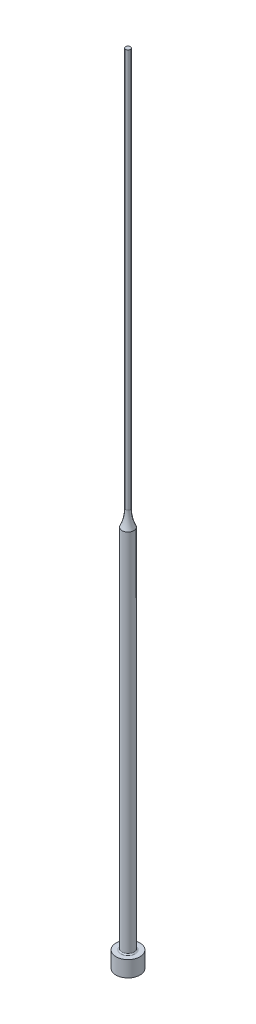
from build123d import *


with BuildPart() as part:
    # Sketch1 → Revolve1 (revolve)
    with BuildSketch(Plane.XY, mode=Mode.PRIVATE) as revolve1_sk:
        with BuildLine():
            Line((0, 0), (3, 0))
            Line((3, 0), (3, 4))
            Line((3, 4), (1.8, 4))
            ThreePointArc((1.8, 4), (1.587867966, 4.087867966), (1.5, 4.3))
            Line((1.5, 4.3), (1.5, 95.853917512))
            ThreePointArc((1.5, 95.853917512), (0.827589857, 97.878679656), (0.6, 100))
            Line((0.6, 100), (0.6, 200))
            Line((0.6, 200), (0, 200))
            Line((0, 200), (0, 0))
        make_face()
    revolve(revolve1_sk.sketch.rotate(Axis((0, 200, 0), (0, -1, 0)), 180), axis=Axis((0, 200, 0), (0, -1, 0)))


solid = part.part
